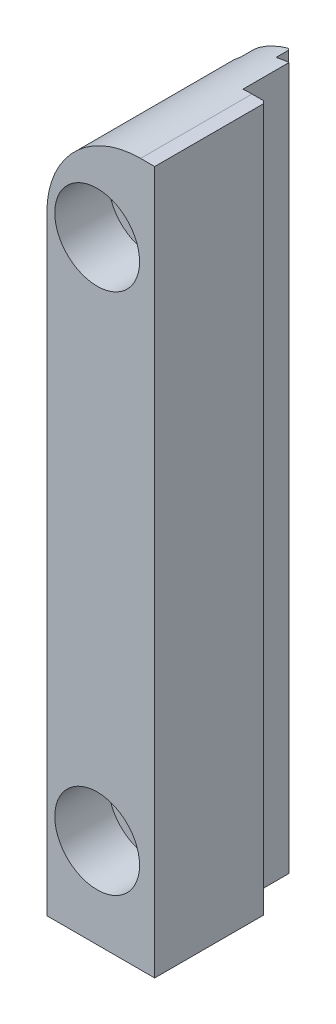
ISO-10303-21;
HEADER;
FILE_DESCRIPTION(('STEP AP214'),'2;1');
FILE_NAME('part.step','',(''),(''),'','','');
FILE_SCHEMA(('AUTOMOTIVE_DESIGN { 1 0 10303 214 1 1 1 1 }'));
ENDSEC;
DATA;
#1=APPLICATION_CONTEXT('core data for automotive mechanical design processes');
#2=APPLICATION_PROTOCOL_DEFINITION('international standard','automotive_design',2000,#1);
#3=PRODUCT_CONTEXT('',#1,'mechanical');
#4=PRODUCT('Part','Part','',(#3));
#5=PRODUCT_RELATED_PRODUCT_CATEGORY('part','',(#4));
#6=PRODUCT_DEFINITION_FORMATION('','',#4);
#7=PRODUCT_DEFINITION_CONTEXT('part definition',#1,'design');
#8=PRODUCT_DEFINITION('design','',#6,#7);
#9=PRODUCT_DEFINITION_SHAPE('','',#8);
#10=(LENGTH_UNIT() NAMED_UNIT(*) SI_UNIT(.MILLI.,.METRE.));
#11=(NAMED_UNIT(*) PLANE_ANGLE_UNIT() SI_UNIT($,.RADIAN.));
#12=(NAMED_UNIT(*) SI_UNIT($,.STERADIAN.) SOLID_ANGLE_UNIT());
#13=UNCERTAINTY_MEASURE_WITH_UNIT(LENGTH_MEASURE(1.E-05),#10,'distance_accuracy_value','');
#14=(GEOMETRIC_REPRESENTATION_CONTEXT(3) GLOBAL_UNCERTAINTY_ASSIGNED_CONTEXT((#13)) GLOBAL_UNIT_ASSIGNED_CONTEXT((#10,
#11,#12)) REPRESENTATION_CONTEXT('',''));
#15=CARTESIAN_POINT('',(0.,0.,0.));
#16=DIRECTION('',(0.,0.,1.));
#17=DIRECTION('',(1.,0.,0.));
#18=AXIS2_PLACEMENT_3D('',#15,#16,#17);
#19=CARTESIAN_POINT('',(-7.32028,29.845,-16.256));
#20=DIRECTION('',(0.,0.,-1.));
#21=DIRECTION('',(1.,0.,0.));
#22=AXIS2_PLACEMENT_3D('',#19,#20,#21);
#23=PLANE('',#22);
#24=CARTESIAN_POINT('',(-5.92328,26.924,-16.256));
#25=DIRECTION('',(0.,0.,-1.));
#26=DIRECTION('',(-1.,0.,0.));
#27=AXIS2_PLACEMENT_3D('',#24,#25,#26);
#28=CIRCLE('',#27,2.7051);
#29=CARTESIAN_POINT('',(-8.62838,26.924,-16.256));
#30=VERTEX_POINT('',#29);
#31=EDGE_CURVE('E343',#30,#30,#28,.T.);
#32=ORIENTED_EDGE('',*,*,#31,.F.);
#33=EDGE_LOOP('',(#32));
#34=FACE_BOUND('',#33,.T.);
#35=CARTESIAN_POINT('',(-5.92328,-26.924,-16.256));
#36=DIRECTION('',(0.,0.,-1.));
#37=DIRECTION('',(-1.,0.,0.));
#38=AXIS2_PLACEMENT_3D('',#35,#36,#37);
#39=CIRCLE('',#38,2.7051);
#40=CARTESIAN_POINT('',(-8.62838,-26.924,-16.256));
#41=VERTEX_POINT('',#40);
#42=EDGE_CURVE('E346',#41,#41,#39,.T.);
#43=ORIENTED_EDGE('',*,*,#42,.F.);
#44=EDGE_LOOP('',(#43));
#45=FACE_BOUND('',#44,.T.);
#46=CARTESIAN_POINT('',(-5.92328,26.924,-16.256));
#47=DIRECTION('',(0.,0.,1.));
#48=DIRECTION('',(1.,0.,0.));
#49=AXIS2_PLACEMENT_3D('',#46,#47,#48);
#50=CIRCLE('',#49,3.175);
#51=CARTESIAN_POINT('',(-2.74828,26.924,-16.256));
#52=VERTEX_POINT('',#51);
#53=CARTESIAN_POINT('',(-2.74828030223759,26.9226146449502,-16.256));
#54=VERTEX_POINT('',#53);
#55=EDGE_CURVE('E341',#52,#54,#50,.T.);
#56=ORIENTED_EDGE('',*,*,#55,.F.);
#57=DIRECTION('',(-1.,0.,0.));
#58=VECTOR('',#57,1.);
#59=CARTESIAN_POINT('',(-7.32028,26.924,-16.256));
#60=LINE('',#59,#58);
#61=CARTESIAN_POINT('',(-2.748026,26.924,-16.256));
#62=VERTEX_POINT('',#61);
#63=EDGE_CURVE('E24',#52,#62,#60,.F.);
#64=ORIENTED_EDGE('',*,*,#63,.T.);
#65=CARTESIAN_POINT('',(-5.92328,26.924,-16.256));
#66=DIRECTION('',(0.,0.,-1.));
#67=DIRECTION('',(-1.,0.,0.));
#68=AXIS2_PLACEMENT_3D('',#65,#66,#67);
#69=CIRCLE('',#68,3.175254);
#70=CARTESIAN_POINT('',(-3.76428,29.2522948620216,-16.256));
#71=VERTEX_POINT('',#70);
#72=EDGE_CURVE('E244',#71,#62,#69,.T.);
#73=ORIENTED_EDGE('',*,*,#72,.F.);
#74=DIRECTION('',(0.,-1.,0.));
#75=VECTOR('',#74,1.);
#76=CARTESIAN_POINT('',(-3.76428,29.845,-16.256));
#77=LINE('',#76,#75);
#78=CARTESIAN_POINT('',(-3.76428,35.9141543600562,-16.256));
#79=VERTEX_POINT('',#78);
#80=EDGE_CURVE('E401',#79,#71,#77,.T.);
#81=ORIENTED_EDGE('',*,*,#80,.F.);
#82=CARTESIAN_POINT('',(-1.45288,26.543,-16.256));
#83=DIRECTION('',(0.,0.,1.));
#84=DIRECTION('',(1.,0.,0.));
#85=AXIS2_PLACEMENT_3D('',#82,#83,#84);
#86=CIRCLE('',#85,9.652);
#87=CARTESIAN_POINT('',(-2.40538,36.1478866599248,-16.256));
#88=VERTEX_POINT('',#87);
#89=EDGE_CURVE('E457',#88,#79,#86,.T.);
#90=ORIENTED_EDGE('',*,*,#89,.F.);
#91=DIRECTION('',(0.,-1.,0.));
#92=VECTOR('',#91,1.);
#93=CARTESIAN_POINT('',(-2.40538,29.845,-16.256));
#94=LINE('',#93,#92);
#95=CARTESIAN_POINT('',(-2.40538,-36.195,-16.256));
#96=VERTEX_POINT('',#95);
#97=EDGE_CURVE('E611',#88,#96,#94,.T.);
#98=ORIENTED_EDGE('',*,*,#97,.T.);
#99=DIRECTION('',(-1.,0.,0.));
#100=VECTOR('',#99,1.);
#101=CARTESIAN_POINT('',(-11.07948,-36.195,-16.256));
#102=LINE('',#101,#100);
#103=CARTESIAN_POINT('',(-3.76428,-36.195,-16.256));
#104=VERTEX_POINT('',#103);
#105=EDGE_CURVE('E497',#96,#104,#102,.T.);
#106=ORIENTED_EDGE('',*,*,#105,.T.);
#107=CARTESIAN_POINT('',(-3.76428,-29.2522948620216,-16.256));
#108=VERTEX_POINT('',#107);
#109=EDGE_CURVE('E370',#108,#104,#77,.T.);
#110=ORIENTED_EDGE('',*,*,#109,.F.);
#111=CARTESIAN_POINT('',(-5.92328,-26.924,-16.256));
#112=DIRECTION('',(0.,0.,-1.));
#113=DIRECTION('',(-1.,0.,0.));
#114=AXIS2_PLACEMENT_3D('',#111,#112,#113);
#115=CIRCLE('',#114,3.175254);
#116=CARTESIAN_POINT('',(-2.74802630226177,-26.9253854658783,-16.256));
#117=VERTEX_POINT('',#116);
#118=EDGE_CURVE('E324',#117,#108,#115,.T.);
#119=ORIENTED_EDGE('',*,*,#118,.F.);
#120=DIRECTION('',(-0.999999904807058,0.000436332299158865,0.));
#121=VECTOR('',#120,1.);
#122=CARTESIAN_POINT('',(-7.34504987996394,-26.9233796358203,-16.256));
#123=LINE('',#122,#121);
#124=CARTESIAN_POINT('',(-2.7482803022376,-26.9253853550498,-16.256));
#125=VERTEX_POINT('',#124);
#126=EDGE_CURVE('E376',#117,#125,#123,.T.);
#127=ORIENTED_EDGE('',*,*,#126,.T.);
#128=CARTESIAN_POINT('',(-5.92328,-26.924,-16.256));
#129=DIRECTION('',(0.,0.,1.));
#130=DIRECTION('',(1.,0.,0.));
#131=AXIS2_PLACEMENT_3D('',#128,#129,#130);
#132=CIRCLE('',#131,3.175);
#133=CARTESIAN_POINT('',(-2.74828,-26.924,-16.256));
#134=VERTEX_POINT('',#133);
#135=EDGE_CURVE('E339',#134,#125,#132,.T.);
#136=ORIENTED_EDGE('',*,*,#135,.F.);
#137=DIRECTION('',(-1.,0.,0.));
#138=VECTOR('',#137,1.);
#139=CARTESIAN_POINT('',(-7.32028,-26.924,-16.256));
#140=LINE('',#139,#138);
#141=CARTESIAN_POINT('',(-2.748026,-26.924,-16.256));
#142=VERTEX_POINT('',#141);
#143=EDGE_CURVE('E373',#134,#142,#140,.F.);
#144=ORIENTED_EDGE('',*,*,#143,.T.);
#145=CARTESIAN_POINT('',(-3.76428,-24.5957051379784,-16.256));
#146=VERTEX_POINT('',#145);
#147=EDGE_CURVE('E323',#146,#142,#115,.T.);
#148=ORIENTED_EDGE('',*,*,#147,.F.);
#149=CARTESIAN_POINT('',(-3.76428,24.5957051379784,-16.256));
#150=VERTEX_POINT('',#149);
#151=EDGE_CURVE('E372',#150,#146,#77,.T.);
#152=ORIENTED_EDGE('',*,*,#151,.F.);
#153=CARTESIAN_POINT('',(-2.74802630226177,26.9226145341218,-16.256));
#154=VERTEX_POINT('',#153);
#155=EDGE_CURVE('E274',#154,#150,#69,.T.);
#156=ORIENTED_EDGE('',*,*,#155,.F.);
#157=DIRECTION('',(-0.999999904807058,0.000436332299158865,0.));
#158=VECTOR('',#157,1.);
#159=CARTESIAN_POINT('',(-7.32155426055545,26.9246101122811,-16.256));
#160=LINE('',#159,#158);
#161=EDGE_CURVE('E10',#154,#54,#160,.T.);
#162=ORIENTED_EDGE('',*,*,#161,.T.);
#163=EDGE_LOOP('',(#56,#64,#73,#81,#90,#98,#106,#110,#119,#127,#136,#144,#148,#152,#156,#162));
#164=FACE_BOUND('',#163,.T.);
#165=ADVANCED_FACE('F16',(#34,#45,#164),#23,.T.);
#166=CARTESIAN_POINT('',(-5.92328,26.924,-5.5372));
#167=DIRECTION('',(0.,0.,-1.));
#168=DIRECTION('',(-1.,0.,0.));
#169=AXIS2_PLACEMENT_3D('',#166,#167,#168);
#170=PLANE('',#169);
#171=CARTESIAN_POINT('',(-5.92328,26.924,-5.5372));
#172=DIRECTION('',(0.,0.,-1.));
#173=DIRECTION('',(-1.,0.,0.));
#174=AXIS2_PLACEMENT_3D('',#171,#172,#173);
#175=CIRCLE('',#174,2.7051);
#176=CARTESIAN_POINT('',(-8.62838,26.924,-5.5372));
#177=VERTEX_POINT('',#176);
#178=EDGE_CURVE('E483',#177,#177,#175,.F.);
#179=ORIENTED_EDGE('',*,*,#178,.F.);
#180=EDGE_LOOP('',(#179));
#181=FACE_BOUND('',#180,.T.);
#182=CARTESIAN_POINT('',(-5.92328,26.924,-5.5372));
#183=DIRECTION('',(0.,0.,-1.));
#184=DIRECTION('',(-1.,0.,0.));
#185=AXIS2_PLACEMENT_3D('',#182,#183,#184);
#186=CIRCLE('',#185,4.365625);
#187=CARTESIAN_POINT('',(-10.288905,26.924,-5.5372));
#188=VERTEX_POINT('',#187);
#189=EDGE_CURVE('E507',#188,#188,#186,.T.);
#190=ORIENTED_EDGE('',*,*,#189,.F.);
#191=EDGE_LOOP('',(#190));
#192=FACE_BOUND('',#191,.T.);
#193=CARTESIAN_POINT('',(-5.92328,26.924,-5.5372));
#194=DIRECTION('',(0.,0.,1.));
#195=DIRECTION('',(1.,0.,0.));
#196=AXIS2_PLACEMENT_3D('',#193,#194,#195);
#197=CIRCLE('',#196,3.175254);
#198=CARTESIAN_POINT('',(-2.748026,26.924,-5.5372));
#199=VERTEX_POINT('',#198);
#200=CARTESIAN_POINT('',(-2.74802630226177,26.9226145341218,-5.5372));
#201=VERTEX_POINT('',#200);
#202=EDGE_CURVE('E241',#199,#201,#197,.T.);
#203=ORIENTED_EDGE('',*,*,#202,.F.);
#204=DIRECTION('',(1.,0.,0.));
#205=VECTOR('',#204,1.);
#206=CARTESIAN_POINT('',(-2.74828,26.924,-5.5372));
#207=LINE('',#206,#205);
#208=CARTESIAN_POINT('',(-2.74828,26.924,-5.5372));
#209=VERTEX_POINT('',#208);
#210=EDGE_CURVE('E249',#199,#209,#207,.F.);
#211=ORIENTED_EDGE('',*,*,#210,.T.);
#212=CARTESIAN_POINT('',(-5.92328,26.924,-5.5372));
#213=DIRECTION('',(0.,0.,1.));
#214=DIRECTION('',(1.,0.,0.));
#215=AXIS2_PLACEMENT_3D('',#212,#213,#214);
#216=CIRCLE('',#215,3.175);
#217=CARTESIAN_POINT('',(-2.74828030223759,26.9226146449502,-5.5372));
#218=VERTEX_POINT('',#217);
#219=EDGE_CURVE('E264',#209,#218,#216,.T.);
#220=ORIENTED_EDGE('',*,*,#219,.T.);
#221=DIRECTION('',(0.999999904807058,-0.000436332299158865,0.));
#222=VECTOR('',#221,1.);
#223=CARTESIAN_POINT('',(-2.74828030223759,26.9226146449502,-5.5372));
#224=LINE('',#223,#222);
#225=EDGE_CURVE('E254',#201,#218,#224,.F.);
#226=ORIENTED_EDGE('',*,*,#225,.F.);
#227=EDGE_LOOP('',(#203,#211,#220,#226));
#228=FACE_BOUND('',#227,.T.);
#229=ADVANCED_FACE('F257',(#181,#192,#228),#170,.F.);
#230=CARTESIAN_POINT('',(-7.32028,24.0725742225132,-16.256));
#231=VERTEX_POINT('',#230);
#232=CARTESIAN_POINT('',(-7.32028,29.7754257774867,-16.256));
#233=VERTEX_POINT('',#232);
#234=EDGE_CURVE('E275',#231,#233,#69,.T.);
#235=ORIENTED_EDGE('',*,*,#234,.F.);
#236=DIRECTION('',(0.,-1.,0.));
#237=VECTOR('',#236,1.);
#238=CARTESIAN_POINT('',(-7.32028,29.845,-16.256));
#239=LINE('',#238,#237);
#240=CARTESIAN_POINT('',(-7.32028,-24.0725742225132,-16.256));
#241=VERTEX_POINT('',#240);
#242=EDGE_CURVE('E365',#231,#241,#239,.T.);
#243=ORIENTED_EDGE('',*,*,#242,.T.);
#244=CARTESIAN_POINT('',(-7.32028,-29.7754257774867,-16.256));
#245=VERTEX_POINT('',#244);
#246=EDGE_CURVE('E319',#245,#241,#115,.T.);
#247=ORIENTED_EDGE('',*,*,#246,.F.);
#248=CARTESIAN_POINT('',(-7.32028,-36.195,-16.256));
#249=VERTEX_POINT('',#248);
#250=EDGE_CURVE('E362',#245,#249,#239,.T.);
#251=ORIENTED_EDGE('',*,*,#250,.T.);
#252=DIRECTION('',(-1.,0.,0.));
#253=VECTOR('',#252,1.);
#254=CARTESIAN_POINT('',(-11.07948,-36.195,-16.256));
#255=LINE('',#254,#253);
#256=CARTESIAN_POINT('',(-11.10488,-36.195,-16.256));
#257=VERTEX_POINT('',#256);
#258=EDGE_CURVE('E475',#249,#257,#255,.T.);
#259=ORIENTED_EDGE('',*,*,#258,.T.);
#260=DIRECTION('',(0.,-1.,0.));
#261=VECTOR('',#260,1.);
#262=CARTESIAN_POINT('',(-11.10488,29.845,-16.256));
#263=LINE('',#262,#261);
#264=CARTESIAN_POINT('',(-11.10488,26.543,-16.256));
#265=VERTEX_POINT('',#264);
#266=EDGE_CURVE('E366',#265,#257,#263,.T.);
#267=ORIENTED_EDGE('',*,*,#266,.F.);
#268=CARTESIAN_POINT('',(-1.45288,26.543,-16.256));
#269=DIRECTION('',(0.,0.,1.));
#270=DIRECTION('',(1.,0.,0.));
#271=AXIS2_PLACEMENT_3D('',#268,#269,#270);
#272=CIRCLE('',#271,9.652);
#273=CARTESIAN_POINT('',(-7.32028,34.2068581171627,-16.256));
#274=VERTEX_POINT('',#273);
#275=EDGE_CURVE('E433',#274,#265,#272,.T.);
#276=ORIENTED_EDGE('',*,*,#275,.F.);
#277=EDGE_CURVE('E357',#274,#233,#239,.T.);
#278=ORIENTED_EDGE('',*,*,#277,.T.);
#279=EDGE_LOOP('',(#235,#243,#247,#251,#259,#267,#276,#278));
#280=FACE_BOUND('',#279,.T.);
#281=ADVANCED_FACE('F431',(#280),#23,.T.);
#282=CARTESIAN_POINT('',(-5.92328,-26.924,-5.5372));
#283=DIRECTION('',(0.,0.,-1.));
#284=DIRECTION('',(-1.,0.,0.));
#285=AXIS2_PLACEMENT_3D('',#282,#283,#284);
#286=PLANE('',#285);
#287=CARTESIAN_POINT('',(-5.92328,-26.924,-5.5372));
#288=DIRECTION('',(0.,0.,-1.));
#289=DIRECTION('',(-1.,0.,0.));
#290=AXIS2_PLACEMENT_3D('',#287,#288,#289);
#291=CIRCLE('',#290,2.7051);
#292=CARTESIAN_POINT('',(-8.62838,-26.924,-5.5372));
#293=VERTEX_POINT('',#292);
#294=EDGE_CURVE('E515',#293,#293,#291,.F.);
#295=ORIENTED_EDGE('',*,*,#294,.F.);
#296=EDGE_LOOP('',(#295));
#297=FACE_BOUND('',#296,.T.);
#298=CARTESIAN_POINT('',(-5.92328,-26.924,-5.5372));
#299=DIRECTION('',(0.,0.,-1.));
#300=DIRECTION('',(-1.,0.,0.));
#301=AXIS2_PLACEMENT_3D('',#298,#299,#300);
#302=CIRCLE('',#301,4.365625);
#303=CARTESIAN_POINT('',(-10.288905,-26.924,-5.5372));
#304=VERTEX_POINT('',#303);
#305=EDGE_CURVE('E518',#304,#304,#302,.T.);
#306=ORIENTED_EDGE('',*,*,#305,.F.);
#307=EDGE_LOOP('',(#306));
#308=FACE_BOUND('',#307,.T.);
#309=CARTESIAN_POINT('',(-5.92328,-26.924,-5.5372));
#310=DIRECTION('',(0.,0.,1.));
#311=DIRECTION('',(1.,0.,0.));
#312=AXIS2_PLACEMENT_3D('',#309,#310,#311);
#313=CIRCLE('',#312,3.175254);
#314=CARTESIAN_POINT('',(-2.748026,-26.924,-5.5372));
#315=VERTEX_POINT('',#314);
#316=CARTESIAN_POINT('',(-2.74802630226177,-26.9253854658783,-5.5372));
#317=VERTEX_POINT('',#316);
#318=EDGE_CURVE('E292',#315,#317,#313,.T.);
#319=ORIENTED_EDGE('',*,*,#318,.F.);
#320=DIRECTION('',(1.,0.,0.));
#321=VECTOR('',#320,1.);
#322=CARTESIAN_POINT('',(-2.74828,-26.924,-5.5372));
#323=LINE('',#322,#321);
#324=CARTESIAN_POINT('',(-2.74828,-26.924,-5.5372));
#325=VERTEX_POINT('',#324);
#326=EDGE_CURVE('E307',#315,#325,#323,.F.);
#327=ORIENTED_EDGE('',*,*,#326,.T.);
#328=CARTESIAN_POINT('',(-5.92328,-26.924,-5.5372));
#329=DIRECTION('',(0.,0.,1.));
#330=DIRECTION('',(1.,0.,0.));
#331=AXIS2_PLACEMENT_3D('',#328,#329,#330);
#332=CIRCLE('',#331,3.175);
#333=CARTESIAN_POINT('',(-2.7482803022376,-26.9253853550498,-5.5372));
#334=VERTEX_POINT('',#333);
#335=EDGE_CURVE('E300',#325,#334,#332,.T.);
#336=ORIENTED_EDGE('',*,*,#335,.T.);
#337=DIRECTION('',(0.999999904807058,-0.000436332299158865,0.));
#338=VECTOR('',#337,1.);
#339=CARTESIAN_POINT('',(-2.7482803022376,-26.9253853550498,-5.5372));
#340=LINE('',#339,#338);
#341=EDGE_CURVE('E304',#317,#334,#340,.F.);
#342=ORIENTED_EDGE('',*,*,#341,.F.);
#343=EDGE_LOOP('',(#319,#327,#336,#342));
#344=FACE_BOUND('',#343,.T.);
#345=ADVANCED_FACE('F18',(#297,#308,#344),#286,.F.);
#346=CARTESIAN_POINT('',(-3.76428,29.845,-16.256));
#347=DIRECTION('',(1.,0.,0.));
#348=DIRECTION('',(0.,0.,1.));
#349=AXIS2_PLACEMENT_3D('',#346,#347,#348);
#350=PLANE('',#349);
#351=DIRECTION('',(0.,0.,1.));
#352=VECTOR('',#351,1.);
#353=CARTESIAN_POINT('',(-3.76428,29.2522948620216,-5.5372));
#354=LINE('',#353,#352);
#355=CARTESIAN_POINT('',(-3.76428,29.2522948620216,-17.526));
#356=VERTEX_POINT('',#355);
#357=EDGE_CURVE('E270',#356,#71,#354,.T.);
#358=ORIENTED_EDGE('',*,*,#357,.F.);
#359=DIRECTION('',(0.,1.,0.));
#360=VECTOR('',#359,1.);
#361=CARTESIAN_POINT('',(-3.76428,29.845,-17.526));
#362=LINE('',#361,#360);
#363=CARTESIAN_POINT('',(-3.76428,35.9141543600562,-17.526));
#364=VERTEX_POINT('',#363);
#365=EDGE_CURVE('E448',#356,#364,#362,.T.);
#366=ORIENTED_EDGE('',*,*,#365,.T.);
#367=DIRECTION('',(0.,0.,1.));
#368=VECTOR('',#367,1.);
#369=CARTESIAN_POINT('',(-3.76428,35.9141543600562,-16.256));
#370=LINE('',#369,#368);
#371=EDGE_CURVE('E452',#79,#364,#370,.F.);
#372=ORIENTED_EDGE('',*,*,#371,.F.);
#373=ORIENTED_EDGE('',*,*,#80,.T.);
#374=EDGE_LOOP('',(#358,#366,#372,#373));
#375=FACE_BOUND('',#374,.T.);
#376=ADVANCED_FACE('F537',(#375),#350,.T.);
#377=CARTESIAN_POINT('',(-3.76428,29.845,-17.78));
#378=DIRECTION('',(0.,0.,-1.));
#379=DIRECTION('',(1.,0.,0.));
#380=AXIS2_PLACEMENT_3D('',#377,#378,#379);
#381=PLANE('',#380);
#382=CARTESIAN_POINT('',(-5.92328,26.924,-17.78));
#383=DIRECTION('',(0.,0.,-1.));
#384=DIRECTION('',(-1.,0.,0.));
#385=AXIS2_PLACEMENT_3D('',#382,#383,#384);
#386=CIRCLE('',#385,3.175254);
#387=CARTESIAN_POINT('',(-7.06628,29.886395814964,-17.78));
#388=VERTEX_POINT('',#387);
#389=CARTESIAN_POINT('',(-4.01828,29.4643174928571,-17.78));
#390=VERTEX_POINT('',#389);
#391=EDGE_CURVE('E31',#388,#390,#386,.T.);
#392=ORIENTED_EDGE('',*,*,#391,.F.);
#393=DIRECTION('',(0.,1.,0.));
#394=VECTOR('',#393,1.);
#395=CARTESIAN_POINT('',(-7.06628,29.845,-17.78));
#396=LINE('',#395,#394);
#397=CARTESIAN_POINT('',(-7.06628,34.3948051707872,-17.78));
#398=VERTEX_POINT('',#397);
#399=EDGE_CURVE('E403',#388,#398,#396,.T.);
#400=ORIENTED_EDGE('',*,*,#399,.T.);
#401=CARTESIAN_POINT('',(-1.45288,26.543,-17.78));
#402=DIRECTION('',(0.,0.,1.));
#403=DIRECTION('',(1.,0.,0.));
#404=AXIS2_PLACEMENT_3D('',#401,#402,#403);
#405=CIRCLE('',#404,9.652);
#406=CARTESIAN_POINT('',(-4.01828,35.8478281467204,-17.78));
#407=VERTEX_POINT('',#406);
#408=EDGE_CURVE('E440',#407,#398,#405,.T.);
#409=ORIENTED_EDGE('',*,*,#408,.F.);
#410=DIRECTION('',(0.,-1.,0.));
#411=VECTOR('',#410,1.);
#412=CARTESIAN_POINT('',(-4.01828,29.845,-17.78));
#413=LINE('',#412,#411);
#414=EDGE_CURVE('E395',#407,#390,#413,.T.);
#415=ORIENTED_EDGE('',*,*,#414,.T.);
#416=EDGE_LOOP('',(#392,#400,#409,#415));
#417=FACE_BOUND('',#416,.T.);
#418=ADVANCED_FACE('F546',(#417),#381,.T.);
#419=CARTESIAN_POINT('',(-7.32028,29.845,-17.526));
#420=DIRECTION('',(0.707106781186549,0.,0.707106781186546));
#421=DIRECTION('',(0.707106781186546,0.,-0.707106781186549));
#422=AXIS2_PLACEMENT_3D('',#419,#420,#421);
#423=PLANE('',#422);
#424=CARTESIAN_POINT('',(-5.92328,26.924,-18.923));
#425=DIRECTION('',(0.707106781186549,0.,0.707106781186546));
#426=DIRECTION('',(-0.707106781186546,0.,0.707106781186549));
#427=AXIS2_PLACEMENT_3D('',#424,#425,#426);
#428=ELLIPSE('',#427,4.49048727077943,3.175254);
#429=CARTESIAN_POINT('',(-7.32028,29.7754257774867,-17.526));
#430=VERTEX_POINT('',#429);
#431=EDGE_CURVE('E273',#430,#388,#428,.F.);
#432=ORIENTED_EDGE('',*,*,#431,.F.);
#433=DIRECTION('',(0.,-1.,0.));
#434=VECTOR('',#433,1.);
#435=CARTESIAN_POINT('',(-7.32028,29.845,-17.526));
#436=LINE('',#435,#434);
#437=CARTESIAN_POINT('',(-7.32028,34.2068581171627,-17.526));
#438=VERTEX_POINT('',#437);
#439=EDGE_CURVE('E429',#438,#430,#436,.T.);
#440=ORIENTED_EDGE('',*,*,#439,.F.);
#441=CARTESIAN_POINT('',(-1.45288,26.543,-23.3934));
#442=DIRECTION('',(0.707106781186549,0.,0.707106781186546));
#443=DIRECTION('',(-0.707106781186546,0.,0.707106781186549));
#444=AXIS2_PLACEMENT_3D('',#441,#442,#443);
#445=ELLIPSE('',#444,13.6499893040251,9.652);
#446=EDGE_CURVE('E446',#398,#438,#445,.T.);
#447=ORIENTED_EDGE('',*,*,#446,.F.);
#448=ORIENTED_EDGE('',*,*,#399,.F.);
#449=EDGE_LOOP('',(#432,#440,#447,#448));
#450=FACE_BOUND('',#449,.T.);
#451=ADVANCED_FACE('F550',(#450),#423,.F.);
#452=CARTESIAN_POINT('',(-7.32028,29.845,-17.78));
#453=DIRECTION('',(-1.,0.,0.));
#454=DIRECTION('',(0.,0.,-1.));
#455=AXIS2_PLACEMENT_3D('',#452,#453,#454);
#456=PLANE('',#455);
#457=DIRECTION('',(0.,0.,1.));
#458=VECTOR('',#457,1.);
#459=CARTESIAN_POINT('',(-7.32028,24.0725742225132,-5.5372));
#460=LINE('',#459,#458);
#461=CARTESIAN_POINT('',(-7.32028,24.0725742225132,-17.526));
#462=VERTEX_POINT('',#461);
#463=EDGE_CURVE('E279',#462,#231,#460,.T.);
#464=ORIENTED_EDGE('',*,*,#463,.F.);
#465=CARTESIAN_POINT('',(-7.32028,-24.0725742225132,-17.526));
#466=VERTEX_POINT('',#465);
#467=EDGE_CURVE('E399',#462,#466,#436,.T.);
#468=ORIENTED_EDGE('',*,*,#467,.T.);
#469=DIRECTION('',(0.,0.,1.));
#470=VECTOR('',#469,1.);
#471=CARTESIAN_POINT('',(-7.32028,-24.0725742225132,-5.5372));
#472=LINE('',#471,#470);
#473=EDGE_CURVE('E326',#241,#466,#472,.F.);
#474=ORIENTED_EDGE('',*,*,#473,.F.);
#475=ORIENTED_EDGE('',*,*,#242,.F.);
#476=EDGE_LOOP('',(#464,#468,#474,#475));
#477=FACE_BOUND('',#476,.T.);
#478=ADVANCED_FACE('F554',(#477),#456,.T.);
#479=CARTESIAN_POINT('',(-4.01828,29.845,-17.78));
#480=DIRECTION('',(-0.707106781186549,0.,0.707106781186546));
#481=DIRECTION('',(0.707106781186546,0.,0.707106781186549));
#482=AXIS2_PLACEMENT_3D('',#479,#480,#481);
#483=PLANE('',#482);
#484=CARTESIAN_POINT('',(-5.92328,26.924,-19.685));
#485=DIRECTION('',(-0.707106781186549,0.,0.707106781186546));
#486=DIRECTION('',(0.707106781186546,0.,0.707106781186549));
#487=AXIS2_PLACEMENT_3D('',#484,#485,#486);
#488=ELLIPSE('',#487,4.49048727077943,3.175254);
#489=CARTESIAN_POINT('',(-3.76428,24.5957051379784,-17.526));
#490=VERTEX_POINT('',#489);
#491=CARTESIAN_POINT('',(-4.01828,24.3836825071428,-17.78));
#492=VERTEX_POINT('',#491);
#493=EDGE_CURVE('E285',#490,#492,#488,.F.);
#494=ORIENTED_EDGE('',*,*,#493,.F.);
#495=CARTESIAN_POINT('',(-3.76428,-24.5957051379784,-17.526));
#496=VERTEX_POINT('',#495);
#497=EDGE_CURVE('E527',#496,#490,#362,.T.);
#498=ORIENTED_EDGE('',*,*,#497,.F.);
#499=CARTESIAN_POINT('',(-5.92328,-26.924,-19.685));
#500=DIRECTION('',(-0.707106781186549,0.,0.707106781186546));
#501=DIRECTION('',(0.707106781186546,0.,0.707106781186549));
#502=AXIS2_PLACEMENT_3D('',#499,#500,#501);
#503=ELLIPSE('',#502,4.49048727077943,3.175254);
#504=CARTESIAN_POINT('',(-4.01828,-24.3836825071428,-17.78));
#505=VERTEX_POINT('',#504);
#506=EDGE_CURVE('E334',#505,#496,#503,.F.);
#507=ORIENTED_EDGE('',*,*,#506,.F.);
#508=EDGE_CURVE('E383',#492,#505,#413,.T.);
#509=ORIENTED_EDGE('',*,*,#508,.F.);
#510=EDGE_LOOP('',(#494,#498,#507,#509));
#511=FACE_BOUND('',#510,.T.);
#512=ADVANCED_FACE('F635',(#511),#483,.F.);
#513=DIRECTION('',(0.,0.,1.));
#514=VECTOR('',#513,1.);
#515=CARTESIAN_POINT('',(-3.76428,24.5957051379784,-5.5372));
#516=LINE('',#515,#514);
#517=EDGE_CURVE('E287',#150,#490,#516,.F.);
#518=ORIENTED_EDGE('',*,*,#517,.F.);
#519=ORIENTED_EDGE('',*,*,#151,.T.);
#520=DIRECTION('',(0.,0.,1.));
#521=VECTOR('',#520,1.);
#522=CARTESIAN_POINT('',(-3.76428,-24.5957051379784,-5.5372));
#523=LINE('',#522,#521);
#524=EDGE_CURVE('E336',#496,#146,#523,.T.);
#525=ORIENTED_EDGE('',*,*,#524,.F.);
#526=ORIENTED_EDGE('',*,*,#497,.T.);
#527=EDGE_LOOP('',(#518,#519,#525,#526));
#528=FACE_BOUND('',#527,.T.);
#529=ADVANCED_FACE('F649',(#528),#350,.T.);
#530=CARTESIAN_POINT('',(-5.92328,26.924,-17.78));
#531=DIRECTION('',(0.,0.,-1.));
#532=DIRECTION('',(-1.,0.,0.));
#533=AXIS2_PLACEMENT_3D('',#530,#531,#532);
#534=CIRCLE('',#533,3.175254);
#535=CARTESIAN_POINT('',(-7.06628,23.961604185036,-17.78));
#536=VERTEX_POINT('',#535);
#537=EDGE_CURVE('E283',#492,#536,#534,.T.);
#538=ORIENTED_EDGE('',*,*,#537,.F.);
#539=ORIENTED_EDGE('',*,*,#508,.T.);
#540=CARTESIAN_POINT('',(-5.92328,-26.924,-17.78));
#541=DIRECTION('',(0.,0.,-1.));
#542=DIRECTION('',(-1.,0.,0.));
#543=AXIS2_PLACEMENT_3D('',#540,#541,#542);
#544=CIRCLE('',#543,3.175254);
#545=CARTESIAN_POINT('',(-7.06628,-23.961604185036,-17.78));
#546=VERTEX_POINT('',#545);
#547=EDGE_CURVE('E331',#546,#505,#544,.T.);
#548=ORIENTED_EDGE('',*,*,#547,.F.);
#549=EDGE_CURVE('E385',#546,#536,#396,.T.);
#550=ORIENTED_EDGE('',*,*,#549,.T.);
#551=EDGE_LOOP('',(#538,#539,#548,#550));
#552=FACE_BOUND('',#551,.T.);
#553=ADVANCED_FACE('F807',(#552),#381,.T.);
#554=DIRECTION('',(0.,0.,1.));
#555=VECTOR('',#554,1.);
#556=CARTESIAN_POINT('',(-7.32028,-29.7754257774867,-5.5372));
#557=LINE('',#556,#555);
#558=CARTESIAN_POINT('',(-7.32028,-29.7754257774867,-17.526));
#559=VERTEX_POINT('',#558);
#560=EDGE_CURVE('E317',#559,#245,#557,.T.);
#561=ORIENTED_EDGE('',*,*,#560,.F.);
#562=CARTESIAN_POINT('',(-7.32028,-36.195,-17.526));
#563=VERTEX_POINT('',#562);
#564=EDGE_CURVE('E367',#559,#563,#436,.T.);
#565=ORIENTED_EDGE('',*,*,#564,.T.);
#566=DIRECTION('',(0.,0.,1.));
#567=VECTOR('',#566,1.);
#568=CARTESIAN_POINT('',(-7.32028,-36.195,-11.4808));
#569=LINE('',#568,#567);
#570=EDGE_CURVE('E472',#563,#249,#569,.T.);
#571=ORIENTED_EDGE('',*,*,#570,.T.);
#572=ORIENTED_EDGE('',*,*,#250,.F.);
#573=EDGE_LOOP('',(#561,#565,#571,#572));
#574=FACE_BOUND('',#573,.T.);
#575=ADVANCED_FACE('F583',(#574),#456,.T.);
#576=CARTESIAN_POINT('',(-5.92328,26.924,-18.923));
#577=DIRECTION('',(0.707106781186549,0.,0.707106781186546));
#578=DIRECTION('',(-0.707106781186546,0.,0.707106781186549));
#579=AXIS2_PLACEMENT_3D('',#576,#577,#578);
#580=ELLIPSE('',#579,4.49048727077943,3.175254);
#581=EDGE_CURVE('E281',#536,#462,#580,.F.);
#582=ORIENTED_EDGE('',*,*,#581,.F.);
#583=ORIENTED_EDGE('',*,*,#549,.F.);
#584=CARTESIAN_POINT('',(-5.92328,-26.924,-18.923));
#585=DIRECTION('',(0.707106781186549,0.,0.707106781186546));
#586=DIRECTION('',(-0.707106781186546,0.,0.707106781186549));
#587=AXIS2_PLACEMENT_3D('',#584,#585,#586);
#588=ELLIPSE('',#587,4.49048727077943,3.175254);
#589=EDGE_CURVE('E329',#466,#546,#588,.F.);
#590=ORIENTED_EDGE('',*,*,#589,.F.);
#591=ORIENTED_EDGE('',*,*,#467,.F.);
#592=EDGE_LOOP('',(#582,#583,#590,#591));
#593=FACE_BOUND('',#592,.T.);
#594=ADVANCED_FACE('F563',(#593),#423,.F.);
#595=CARTESIAN_POINT('',(-5.92328,-26.924,-19.685));
#596=DIRECTION('',(-0.707106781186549,0.,0.707106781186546));
#597=DIRECTION('',(0.707106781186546,0.,0.707106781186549));
#598=AXIS2_PLACEMENT_3D('',#595,#596,#597);
#599=ELLIPSE('',#598,4.49048727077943,3.175254);
#600=CARTESIAN_POINT('',(-3.76428,-29.2522948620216,-17.526));
#601=VERTEX_POINT('',#600);
#602=CARTESIAN_POINT('',(-4.01828,-29.4643174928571,-17.78));
#603=VERTEX_POINT('',#602);
#604=EDGE_CURVE('E315',#601,#603,#599,.F.);
#605=ORIENTED_EDGE('',*,*,#604,.F.);
#606=CARTESIAN_POINT('',(-3.76428,-36.195,-17.526));
#607=VERTEX_POINT('',#606);
#608=EDGE_CURVE('E523',#607,#601,#362,.T.);
#609=ORIENTED_EDGE('',*,*,#608,.F.);
#610=DIRECTION('',(-0.707106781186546,0.,-0.707106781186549));
#611=VECTOR('',#610,1.);
#612=CARTESIAN_POINT('',(-4.01828,-36.195,-17.78));
#613=LINE('',#612,#611);
#614=CARTESIAN_POINT('',(-4.01828,-36.195,-17.78));
#615=VERTEX_POINT('',#614);
#616=EDGE_CURVE('E492',#615,#607,#613,.F.);
#617=ORIENTED_EDGE('',*,*,#616,.F.);
#618=EDGE_CURVE('E380',#603,#615,#413,.T.);
#619=ORIENTED_EDGE('',*,*,#618,.F.);
#620=EDGE_LOOP('',(#605,#609,#617,#619));
#621=FACE_BOUND('',#620,.T.);
#622=ADVANCED_FACE('F630',(#621),#483,.F.);
#623=CARTESIAN_POINT('',(-5.92328,-26.924,0.));
#624=DIRECTION('',(0.,0.,-1.));
#625=DIRECTION('',(-1.,0.,0.));
#626=AXIS2_PLACEMENT_3D('',#623,#624,#625);
#627=CYLINDRICAL_SURFACE('',#626,2.7051);
#628=ORIENTED_EDGE('',*,*,#294,.T.);
#629=EDGE_LOOP('',(#628));
#630=FACE_BOUND('',#629,.T.);
#631=ORIENTED_EDGE('',*,*,#42,.T.);
#632=EDGE_LOOP('',(#631));
#633=FACE_BOUND('',#632,.T.);
#634=ADVANCED_FACE('F633',(#630,#633),#627,.F.);
#635=CARTESIAN_POINT('',(-5.92328,26.924,0.));
#636=DIRECTION('',(0.,0.,-1.));
#637=DIRECTION('',(-1.,0.,0.));
#638=AXIS2_PLACEMENT_3D('',#635,#636,#637);
#639=CYLINDRICAL_SURFACE('',#638,2.7051);
#640=ORIENTED_EDGE('',*,*,#178,.T.);
#641=EDGE_LOOP('',(#640));
#642=FACE_BOUND('',#641,.T.);
#643=ORIENTED_EDGE('',*,*,#31,.T.);
#644=EDGE_LOOP('',(#643));
#645=FACE_BOUND('',#644,.T.);
#646=ADVANCED_FACE('F641',(#642,#645),#639,.F.);
#647=CARTESIAN_POINT('',(-11.10488,29.845,-16.256));
#648=DIRECTION('',(-1.,0.,0.));
#649=DIRECTION('',(0.,0.,-1.));
#650=AXIS2_PLACEMENT_3D('',#647,#648,#649);
#651=PLANE('',#650);
#652=ORIENTED_EDGE('',*,*,#266,.T.);
#653=DIRECTION('',(0.,0.,1.));
#654=VECTOR('',#653,1.);
#655=CARTESIAN_POINT('',(-11.10488,-36.195,-11.4808));
#656=LINE('',#655,#654);
#657=CARTESIAN_POINT('',(-11.10488,-36.195,0.));
#658=VERTEX_POINT('',#657);
#659=EDGE_CURVE('E479',#257,#658,#656,.T.);
#660=ORIENTED_EDGE('',*,*,#659,.T.);
#661=DIRECTION('',(0.,-1.,0.));
#662=VECTOR('',#661,1.);
#663=CARTESIAN_POINT('',(-11.10488,29.845,0.));
#664=LINE('',#663,#662);
#665=CARTESIAN_POINT('',(-11.10488,26.543,0.));
#666=VERTEX_POINT('',#665);
#667=EDGE_CURVE('E592',#666,#658,#664,.T.);
#668=ORIENTED_EDGE('',*,*,#667,.F.);
#669=DIRECTION('',(0.,0.,1.));
#670=VECTOR('',#669,1.);
#671=CARTESIAN_POINT('',(-11.10488,26.543,-16.256));
#672=LINE('',#671,#670);
#673=EDGE_CURVE('E443',#265,#666,#672,.T.);
#674=ORIENTED_EDGE('',*,*,#673,.F.);
#675=EDGE_LOOP('',(#652,#660,#668,#674));
#676=FACE_BOUND('',#675,.T.);
#677=ADVANCED_FACE('F591',(#676),#651,.T.);
#678=CARTESIAN_POINT('',(-11.07948,29.845,0.));
#679=DIRECTION('',(0.,0.,1.));
#680=DIRECTION('',(-1.,0.,0.));
#681=AXIS2_PLACEMENT_3D('',#678,#679,#680);
#682=PLANE('',#681);
#683=CARTESIAN_POINT('',(-5.92328,-26.924,0.));
#684=DIRECTION('',(0.,0.,1.));
#685=DIRECTION('',(1.,0.,0.));
#686=AXIS2_PLACEMENT_3D('',#683,#684,#685);
#687=CIRCLE('',#686,4.365625);
#688=CARTESIAN_POINT('',(-1.557655,-26.924,0.));
#689=VERTEX_POINT('',#688);
#690=EDGE_CURVE('E349',#689,#689,#687,.F.);
#691=ORIENTED_EDGE('',*,*,#690,.T.);
#692=EDGE_LOOP('',(#691));
#693=FACE_BOUND('',#692,.T.);
#694=CARTESIAN_POINT('',(-5.92328,26.924,0.));
#695=DIRECTION('',(0.,0.,1.));
#696=DIRECTION('',(1.,0.,0.));
#697=AXIS2_PLACEMENT_3D('',#694,#695,#696);
#698=CIRCLE('',#697,4.365625);
#699=CARTESIAN_POINT('',(-1.557655,26.924,0.));
#700=VERTEX_POINT('',#699);
#701=EDGE_CURVE('E510',#700,#700,#698,.F.);
#702=ORIENTED_EDGE('',*,*,#701,.T.);
#703=EDGE_LOOP('',(#702));
#704=FACE_BOUND('',#703,.T.);
#705=ORIENTED_EDGE('',*,*,#667,.T.);
#706=DIRECTION('',(1.,0.,0.));
#707=VECTOR('',#706,1.);
#708=CARTESIAN_POINT('',(-11.07948,-36.195,0.));
#709=LINE('',#708,#707);
#710=CARTESIAN_POINT('',(0.,-36.195,0.));
#711=VERTEX_POINT('',#710);
#712=EDGE_CURVE('E482',#658,#711,#709,.T.);
#713=ORIENTED_EDGE('',*,*,#712,.T.);
#714=DIRECTION('',(0.,-1.,0.));
#715=VECTOR('',#714,1.);
#716=CARTESIAN_POINT('',(0.,29.845,0.));
#717=LINE('',#716,#715);
#718=CARTESIAN_POINT('',(0.,36.195,0.));
#719=VERTEX_POINT('',#718);
#720=EDGE_CURVE('E604',#719,#711,#717,.T.);
#721=ORIENTED_EDGE('',*,*,#720,.F.);
#722=DIRECTION('',(1.,0.,0.));
#723=VECTOR('',#722,1.);
#724=CARTESIAN_POINT('',(-11.07948,36.195,0.));
#725=LINE('',#724,#723);
#726=CARTESIAN_POINT('',(-1.45288,36.195,0.));
#727=VERTEX_POINT('',#726);
#728=EDGE_CURVE('E478',#727,#719,#725,.T.);
#729=ORIENTED_EDGE('',*,*,#728,.F.);
#730=CARTESIAN_POINT('',(-1.45288,26.543,0.));
#731=DIRECTION('',(0.,0.,-1.));
#732=DIRECTION('',(-1.,0.,0.));
#733=AXIS2_PLACEMENT_3D('',#730,#731,#732);
#734=CIRCLE('',#733,9.652);
#735=EDGE_CURVE('E598',#666,#727,#734,.T.);
#736=ORIENTED_EDGE('',*,*,#735,.F.);
#737=EDGE_LOOP('',(#705,#713,#721,#729,#736));
#738=FACE_BOUND('',#737,.T.);
#739=ADVANCED_FACE('F719',(#693,#704,#738),#682,.T.);
#740=CARTESIAN_POINT('',(0.,29.845,0.));
#741=DIRECTION('',(1.,0.,0.));
#742=DIRECTION('',(0.,0.,1.));
#743=AXIS2_PLACEMENT_3D('',#740,#741,#742);
#744=PLANE('',#743);
#745=DIRECTION('',(0.,0.,-1.));
#746=VECTOR('',#745,1.);
#747=CARTESIAN_POINT('',(0.,-36.195,-11.4808));
#748=LINE('',#747,#746);
#749=CARTESIAN_POINT('',(0.,-36.195,-11.2268));
#750=VERTEX_POINT('',#749);
#751=EDGE_CURVE('E486',#711,#750,#748,.T.);
#752=ORIENTED_EDGE('',*,*,#751,.T.);
#753=DIRECTION('',(0.,1.,0.));
#754=VECTOR('',#753,1.);
#755=CARTESIAN_POINT('',(0.,29.845,-11.2268));
#756=LINE('',#755,#754);
#757=CARTESIAN_POINT('',(0.,36.195,-11.2268));
#758=VERTEX_POINT('',#757);
#759=EDGE_CURVE('E471',#750,#758,#756,.T.);
#760=ORIENTED_EDGE('',*,*,#759,.T.);
#761=DIRECTION('',(0.,0.,-1.));
#762=VECTOR('',#761,1.);
#763=CARTESIAN_POINT('',(0.,36.195,-11.4808));
#764=LINE('',#763,#762);
#765=EDGE_CURVE('E469',#719,#758,#764,.T.);
#766=ORIENTED_EDGE('',*,*,#765,.F.);
#767=ORIENTED_EDGE('',*,*,#720,.T.);
#768=EDGE_LOOP('',(#752,#760,#766,#767));
#769=FACE_BOUND('',#768,.T.);
#770=ADVANCED_FACE('F718',(#769),#744,.T.);
#771=CARTESIAN_POINT('',(0.00380999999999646,29.845,-11.4808));
#772=DIRECTION('',(0.,0.,-1.));
#773=DIRECTION('',(1.,0.,0.));
#774=AXIS2_PLACEMENT_3D('',#771,#772,#773);
#775=PLANE('',#774);
#776=DIRECTION('',(-1.,0.,0.));
#777=VECTOR('',#776,1.);
#778=CARTESIAN_POINT('',(0.00380999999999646,36.195,-11.4808));
#779=LINE('',#778,#777);
#780=CARTESIAN_POINT('',(-0.254000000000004,36.195,-11.4808));
#781=VERTEX_POINT('',#780);
#782=CARTESIAN_POINT('',(-1.45288,36.195,-11.4808));
#783=VERTEX_POINT('',#782);
#784=EDGE_CURVE('E467',#781,#783,#779,.T.);
#785=ORIENTED_EDGE('',*,*,#784,.F.);
#786=DIRECTION('',(0.,-1.,0.));
#787=VECTOR('',#786,1.);
#788=CARTESIAN_POINT('',(-0.254000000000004,29.845,-11.4808));
#789=LINE('',#788,#787);
#790=CARTESIAN_POINT('',(-0.254000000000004,-36.195,-11.4808));
#791=VERTEX_POINT('',#790);
#792=EDGE_CURVE('E526',#781,#791,#789,.T.);
#793=ORIENTED_EDGE('',*,*,#792,.T.);
#794=DIRECTION('',(-1.,0.,0.));
#795=VECTOR('',#794,1.);
#796=CARTESIAN_POINT('',(-11.07948,-36.195,-11.4808));
#797=LINE('',#796,#795);
#798=CARTESIAN_POINT('',(-2.40538,-36.195,-11.4808));
#799=VERTEX_POINT('',#798);
#800=EDGE_CURVE('E489',#791,#799,#797,.T.);
#801=ORIENTED_EDGE('',*,*,#800,.T.);
#802=DIRECTION('',(0.,-1.,0.));
#803=VECTOR('',#802,1.);
#804=CARTESIAN_POINT('',(-2.40538,29.845,-11.4808));
#805=LINE('',#804,#803);
#806=CARTESIAN_POINT('',(-2.40538,36.1478866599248,-11.4808));
#807=VERTEX_POINT('',#806);
#808=EDGE_CURVE('E607',#807,#799,#805,.T.);
#809=ORIENTED_EDGE('',*,*,#808,.F.);
#810=CARTESIAN_POINT('',(-1.45288,26.543,-11.4808));
#811=DIRECTION('',(0.,0.,1.));
#812=DIRECTION('',(1.,0.,0.));
#813=AXIS2_PLACEMENT_3D('',#810,#811,#812);
#814=CIRCLE('',#813,9.652);
#815=EDGE_CURVE('E463',#783,#807,#814,.T.);
#816=ORIENTED_EDGE('',*,*,#815,.F.);
#817=EDGE_LOOP('',(#785,#793,#801,#809,#816));
#818=FACE_BOUND('',#817,.T.);
#819=ADVANCED_FACE('F717',(#818),#775,.T.);
#820=CARTESIAN_POINT('',(-2.40538,29.845,-11.4808));
#821=DIRECTION('',(1.,0.,0.));
#822=DIRECTION('',(0.,0.,1.));
#823=AXIS2_PLACEMENT_3D('',#820,#821,#822);
#824=PLANE('',#823);
#825=DIRECTION('',(0.,0.,-1.));
#826=VECTOR('',#825,1.);
#827=CARTESIAN_POINT('',(-2.40538,-36.195,-11.4808));
#828=LINE('',#827,#826);
#829=EDGE_CURVE('E494',#799,#96,#828,.T.);
#830=ORIENTED_EDGE('',*,*,#829,.T.);
#831=ORIENTED_EDGE('',*,*,#97,.F.);
#832=DIRECTION('',(0.,0.,1.));
#833=VECTOR('',#832,1.);
#834=CARTESIAN_POINT('',(-2.40538,36.1478866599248,-11.4808));
#835=LINE('',#834,#833);
#836=EDGE_CURVE('E460',#807,#88,#835,.F.);
#837=ORIENTED_EDGE('',*,*,#836,.F.);
#838=ORIENTED_EDGE('',*,*,#808,.T.);
#839=EDGE_LOOP('',(#830,#831,#837,#838));
#840=FACE_BOUND('',#839,.T.);
#841=ADVANCED_FACE('F617',(#840),#824,.T.);
#842=DIRECTION('',(0.,0.,1.));
#843=VECTOR('',#842,1.);
#844=CARTESIAN_POINT('',(-3.76428,-29.2522948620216,-5.5372));
#845=LINE('',#844,#843);
#846=EDGE_CURVE('E322',#108,#601,#845,.F.);
#847=ORIENTED_EDGE('',*,*,#846,.F.);
#848=ORIENTED_EDGE('',*,*,#109,.T.);
#849=DIRECTION('',(0.,0.,-1.));
#850=VECTOR('',#849,1.);
#851=CARTESIAN_POINT('',(-3.76428,-36.195,-11.4808));
#852=LINE('',#851,#850);
#853=EDGE_CURVE('E500',#104,#607,#852,.T.);
#854=ORIENTED_EDGE('',*,*,#853,.T.);
#855=ORIENTED_EDGE('',*,*,#608,.T.);
#856=EDGE_LOOP('',(#847,#848,#854,#855));
#857=FACE_BOUND('',#856,.T.);
#858=ADVANCED_FACE('F626',(#857),#350,.T.);
#859=CARTESIAN_POINT('',(-5.92328,-26.924,-17.78));
#860=DIRECTION('',(0.,0.,-1.));
#861=DIRECTION('',(-1.,0.,0.));
#862=AXIS2_PLACEMENT_3D('',#859,#860,#861);
#863=CIRCLE('',#862,3.175254);
#864=CARTESIAN_POINT('',(-7.06628,-29.886395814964,-17.78));
#865=VERTEX_POINT('',#864);
#866=EDGE_CURVE('E313',#603,#865,#863,.T.);
#867=ORIENTED_EDGE('',*,*,#866,.F.);
#868=ORIENTED_EDGE('',*,*,#618,.T.);
#869=DIRECTION('',(-1.,0.,0.));
#870=VECTOR('',#869,1.);
#871=CARTESIAN_POINT('',(-11.07948,-36.195,-17.78));
#872=LINE('',#871,#870);
#873=CARTESIAN_POINT('',(-7.06628,-36.195,-17.78));
#874=VERTEX_POINT('',#873);
#875=EDGE_CURVE('E476',#615,#874,#872,.T.);
#876=ORIENTED_EDGE('',*,*,#875,.T.);
#877=EDGE_CURVE('E454',#874,#865,#396,.T.);
#878=ORIENTED_EDGE('',*,*,#877,.T.);
#879=EDGE_LOOP('',(#867,#868,#876,#878));
#880=FACE_BOUND('',#879,.T.);
#881=ADVANCED_FACE('F571',(#880),#381,.T.);
#882=DIRECTION('',(0.,0.,1.));
#883=VECTOR('',#882,1.);
#884=CARTESIAN_POINT('',(-7.32028,29.7754257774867,-5.5372));
#885=LINE('',#884,#883);
#886=EDGE_CURVE('E277',#233,#430,#885,.F.);
#887=ORIENTED_EDGE('',*,*,#886,.F.);
#888=ORIENTED_EDGE('',*,*,#277,.F.);
#889=DIRECTION('',(0.,0.,1.));
#890=VECTOR('',#889,1.);
#891=CARTESIAN_POINT('',(-7.32028,34.2068581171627,-17.78));
#892=LINE('',#891,#890);
#893=EDGE_CURVE('E438',#438,#274,#892,.T.);
#894=ORIENTED_EDGE('',*,*,#893,.F.);
#895=ORIENTED_EDGE('',*,*,#439,.T.);
#896=EDGE_LOOP('',(#887,#888,#894,#895));
#897=FACE_BOUND('',#896,.T.);
#898=ADVANCED_FACE('F426',(#897),#456,.T.);
#899=CARTESIAN_POINT('',(-11.07948,36.195,-11.4808));
#900=DIRECTION('',(0.,1.,0.));
#901=DIRECTION('',(0.,0.,1.));
#902=AXIS2_PLACEMENT_3D('',#899,#900,#901);
#903=PLANE('',#902);
#904=ORIENTED_EDGE('',*,*,#765,.T.);
#905=DIRECTION('',(0.707106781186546,0.,0.707106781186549));
#906=VECTOR('',#905,1.);
#907=CARTESIAN_POINT('',(-5.66674,36.195,-16.89354));
#908=LINE('',#907,#906);
#909=EDGE_CURVE('E377',#758,#781,#908,.F.);
#910=ORIENTED_EDGE('',*,*,#909,.T.);
#911=ORIENTED_EDGE('',*,*,#784,.T.);
#912=DIRECTION('',(0.,0.,1.));
#913=VECTOR('',#912,1.);
#914=CARTESIAN_POINT('',(-1.45288,36.195,-11.4808));
#915=LINE('',#914,#913);
#916=EDGE_CURVE('E466',#727,#783,#915,.F.);
#917=ORIENTED_EDGE('',*,*,#916,.F.);
#918=ORIENTED_EDGE('',*,*,#728,.T.);
#919=EDGE_LOOP('',(#904,#910,#911,#917,#918));
#920=FACE_BOUND('',#919,.T.);
#921=ADVANCED_FACE('F715',(#920),#903,.T.);
#922=CARTESIAN_POINT('',(-11.07948,-36.195,-11.4808));
#923=DIRECTION('',(0.,1.,0.));
#924=DIRECTION('',(0.,0.,1.));
#925=AXIS2_PLACEMENT_3D('',#922,#923,#924);
#926=PLANE('',#925);
#927=ORIENTED_EDGE('',*,*,#570,.F.);
#928=DIRECTION('',(-0.707106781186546,0.,0.707106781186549));
#929=VECTOR('',#928,1.);
#930=CARTESIAN_POINT('',(-7.32028,-36.195,-17.526));
#931=LINE('',#930,#929);
#932=EDGE_CURVE('E384',#563,#874,#931,.F.);
#933=ORIENTED_EDGE('',*,*,#932,.T.);
#934=ORIENTED_EDGE('',*,*,#875,.F.);
#935=ORIENTED_EDGE('',*,*,#616,.T.);
#936=ORIENTED_EDGE('',*,*,#853,.F.);
#937=ORIENTED_EDGE('',*,*,#105,.F.);
#938=ORIENTED_EDGE('',*,*,#829,.F.);
#939=ORIENTED_EDGE('',*,*,#800,.F.);
#940=DIRECTION('',(-0.707106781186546,0.,-0.707106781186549));
#941=VECTOR('',#940,1.);
#942=CARTESIAN_POINT('',(-0.254,-36.195,-11.4808));
#943=LINE('',#942,#941);
#944=EDGE_CURVE('E490',#791,#750,#943,.F.);
#945=ORIENTED_EDGE('',*,*,#944,.T.);
#946=ORIENTED_EDGE('',*,*,#751,.F.);
#947=ORIENTED_EDGE('',*,*,#712,.F.);
#948=ORIENTED_EDGE('',*,*,#659,.F.);
#949=ORIENTED_EDGE('',*,*,#258,.F.);
#950=EDGE_LOOP('',(#927,#933,#934,#935,#936,#937,#938,#939,#945,#946,#947,#948,#949));
#951=FACE_BOUND('',#950,.T.);
#952=ADVANCED_FACE('F587',(#951),#926,.F.);
#953=CARTESIAN_POINT('',(-1.45288,26.543,-16.256));
#954=DIRECTION('',(0.,0.,1.));
#955=DIRECTION('',(0.,-1.,0.));
#956=AXIS2_PLACEMENT_3D('',#953,#954,#955);
#957=CYLINDRICAL_SURFACE('',#956,9.652);
#958=ORIENTED_EDGE('',*,*,#408,.T.);
#959=ORIENTED_EDGE('',*,*,#446,.T.);
#960=ORIENTED_EDGE('',*,*,#893,.T.);
#961=ORIENTED_EDGE('',*,*,#275,.T.);
#962=ORIENTED_EDGE('',*,*,#673,.T.);
#963=ORIENTED_EDGE('',*,*,#735,.T.);
#964=ORIENTED_EDGE('',*,*,#916,.T.);
#965=ORIENTED_EDGE('',*,*,#815,.T.);
#966=ORIENTED_EDGE('',*,*,#836,.T.);
#967=ORIENTED_EDGE('',*,*,#89,.T.);
#968=ORIENTED_EDGE('',*,*,#371,.T.);
#969=CARTESIAN_POINT('',(-1.45288,26.543,-15.2146));
#970=DIRECTION('',(-0.707106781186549,0.,0.707106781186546));
#971=DIRECTION('',(0.707106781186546,0.,0.707106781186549));
#972=AXIS2_PLACEMENT_3D('',#969,#970,#971);
#973=ELLIPSE('',#972,13.6499893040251,9.652);
#974=EDGE_CURVE('E449',#364,#407,#973,.T.);
#975=ORIENTED_EDGE('',*,*,#974,.T.);
#976=EDGE_LOOP('',(#958,#959,#960,#961,#962,#963,#964,#965,#966,#967,#968,#975));
#977=FACE_BOUND('',#976,.T.);
#978=ADVANCED_FACE('F540',(#977),#957,.T.);
#979=CARTESIAN_POINT('',(-5.92328,-26.924,-18.923));
#980=DIRECTION('',(0.707106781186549,0.,0.707106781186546));
#981=DIRECTION('',(-0.707106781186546,0.,0.707106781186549));
#982=AXIS2_PLACEMENT_3D('',#979,#980,#981);
#983=ELLIPSE('',#982,4.49048727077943,3.175254);
#984=EDGE_CURVE('E310',#865,#559,#983,.F.);
#985=ORIENTED_EDGE('',*,*,#984,.F.);
#986=ORIENTED_EDGE('',*,*,#877,.F.);
#987=ORIENTED_EDGE('',*,*,#932,.F.);
#988=ORIENTED_EDGE('',*,*,#564,.F.);
#989=EDGE_LOOP('',(#985,#986,#987,#988));
#990=FACE_BOUND('',#989,.T.);
#991=ADVANCED_FACE('F577',(#990),#423,.F.);
#992=CARTESIAN_POINT('',(-5.92328,26.924,-19.685));
#993=DIRECTION('',(-0.707106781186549,0.,0.707106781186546));
#994=DIRECTION('',(0.707106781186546,0.,0.707106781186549));
#995=AXIS2_PLACEMENT_3D('',#992,#993,#994);
#996=ELLIPSE('',#995,4.49048727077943,3.175254);
#997=EDGE_CURVE('E253',#390,#356,#996,.F.);
#998=ORIENTED_EDGE('',*,*,#997,.F.);
#999=ORIENTED_EDGE('',*,*,#414,.F.);
#1000=ORIENTED_EDGE('',*,*,#974,.F.);
#1001=ORIENTED_EDGE('',*,*,#365,.F.);
#1002=EDGE_LOOP('',(#998,#999,#1000,#1001));
#1003=FACE_BOUND('',#1002,.T.);
#1004=ADVANCED_FACE('F543',(#1003),#483,.F.);
#1005=CARTESIAN_POINT('',(-0.254000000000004,29.845,-11.4808));
#1006=DIRECTION('',(-0.707106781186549,0.,0.707106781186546));
#1007=DIRECTION('',(0.707106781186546,0.,0.707106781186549));
#1008=AXIS2_PLACEMENT_3D('',#1005,#1006,#1007);
#1009=PLANE('',#1008);
#1010=ORIENTED_EDGE('',*,*,#909,.F.);
#1011=ORIENTED_EDGE('',*,*,#759,.F.);
#1012=ORIENTED_EDGE('',*,*,#944,.F.);
#1013=ORIENTED_EDGE('',*,*,#792,.F.);
#1014=EDGE_LOOP('',(#1010,#1011,#1012,#1013));
#1015=FACE_BOUND('',#1014,.T.);
#1016=ADVANCED_FACE('F647',(#1015),#1009,.F.);
#1017=CARTESIAN_POINT('',(-5.92328,26.924,0.));
#1018=DIRECTION('',(0.,0.,-1.));
#1019=DIRECTION('',(-1.,0.,0.));
#1020=AXIS2_PLACEMENT_3D('',#1017,#1018,#1019);
#1021=CYLINDRICAL_SURFACE('',#1020,4.365625);
#1022=ORIENTED_EDGE('',*,*,#189,.T.);
#1023=EDGE_LOOP('',(#1022));
#1024=FACE_BOUND('',#1023,.T.);
#1025=ORIENTED_EDGE('',*,*,#701,.F.);
#1026=EDGE_LOOP('',(#1025));
#1027=FACE_BOUND('',#1026,.T.);
#1028=ADVANCED_FACE('F696',(#1024,#1027),#1021,.F.);
#1029=CARTESIAN_POINT('',(-5.92328,-26.924,0.));
#1030=DIRECTION('',(0.,0.,-1.));
#1031=DIRECTION('',(-1.,0.,0.));
#1032=AXIS2_PLACEMENT_3D('',#1029,#1030,#1031);
#1033=CYLINDRICAL_SURFACE('',#1032,4.365625);
#1034=ORIENTED_EDGE('',*,*,#305,.T.);
#1035=EDGE_LOOP('',(#1034));
#1036=FACE_BOUND('',#1035,.T.);
#1037=ORIENTED_EDGE('',*,*,#690,.F.);
#1038=EDGE_LOOP('',(#1037));
#1039=FACE_BOUND('',#1038,.T.);
#1040=ADVANCED_FACE('F689',(#1036,#1039),#1033,.F.);
#1041=CARTESIAN_POINT('',(-5.92328,-26.924,-5.5372));
#1042=DIRECTION('',(0.,0.,1.));
#1043=DIRECTION('',(1.,0.,0.));
#1044=AXIS2_PLACEMENT_3D('',#1041,#1042,#1043);
#1045=CYLINDRICAL_SURFACE('',#1044,3.175);
#1046=DIRECTION('',(0.,0.,-1.));
#1047=VECTOR('',#1046,1.);
#1048=CARTESIAN_POINT('',(-2.7482803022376,-26.9253853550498,-5.5372));
#1049=LINE('',#1048,#1047);
#1050=EDGE_CURVE('E296',#334,#125,#1049,.T.);
#1051=ORIENTED_EDGE('',*,*,#1050,.F.);
#1052=ORIENTED_EDGE('',*,*,#335,.F.);
#1053=DIRECTION('',(0.,0.,-1.));
#1054=VECTOR('',#1053,1.);
#1055=CARTESIAN_POINT('',(-2.74828,-26.924,-5.5372));
#1056=LINE('',#1055,#1054);
#1057=EDGE_CURVE('E301',#325,#134,#1056,.T.);
#1058=ORIENTED_EDGE('',*,*,#1057,.T.);
#1059=ORIENTED_EDGE('',*,*,#135,.T.);
#1060=EDGE_LOOP('',(#1051,#1052,#1058,#1059));
#1061=FACE_BOUND('',#1060,.T.);
#1062=ADVANCED_FACE('F687',(#1061),#1045,.T.);
#1063=CARTESIAN_POINT('',(-2.74828,-26.924,-11.8872));
#1064=DIRECTION('',(0.,-1.,0.));
#1065=DIRECTION('',(0.,0.,-1.));
#1066=AXIS2_PLACEMENT_3D('',#1063,#1064,#1065);
#1067=PLANE('',#1066);
#1068=ORIENTED_EDGE('',*,*,#1057,.F.);
#1069=ORIENTED_EDGE('',*,*,#326,.F.);
#1070=DIRECTION('',(0.,0.,1.));
#1071=VECTOR('',#1070,1.);
#1072=CARTESIAN_POINT('',(-2.748026,-26.924,-5.5372));
#1073=LINE('',#1072,#1071);
#1074=EDGE_CURVE('E293',#315,#142,#1073,.F.);
#1075=ORIENTED_EDGE('',*,*,#1074,.T.);
#1076=ORIENTED_EDGE('',*,*,#143,.F.);
#1077=EDGE_LOOP('',(#1068,#1069,#1075,#1076));
#1078=FACE_BOUND('',#1077,.T.);
#1079=ADVANCED_FACE('F685',(#1078),#1067,.F.);
#1080=CARTESIAN_POINT('',(-2.7482803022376,-26.9253853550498,-11.8872));
#1081=DIRECTION('',(-0.000436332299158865,-0.999999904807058,0.));
#1082=DIRECTION('',(0.,0.,-1.));
#1083=AXIS2_PLACEMENT_3D('',#1080,#1081,#1082);
#1084=PLANE('',#1083);
#1085=DIRECTION('',(0.,0.,1.));
#1086=VECTOR('',#1085,1.);
#1087=CARTESIAN_POINT('',(-2.74802630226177,-26.9253854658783,-5.5372));
#1088=LINE('',#1087,#1086);
#1089=EDGE_CURVE('E289',#317,#117,#1088,.F.);
#1090=ORIENTED_EDGE('',*,*,#1089,.F.);
#1091=ORIENTED_EDGE('',*,*,#341,.T.);
#1092=ORIENTED_EDGE('',*,*,#1050,.T.);
#1093=ORIENTED_EDGE('',*,*,#126,.F.);
#1094=EDGE_LOOP('',(#1090,#1091,#1092,#1093));
#1095=FACE_BOUND('',#1094,.T.);
#1096=ADVANCED_FACE('F680',(#1095),#1084,.T.);
#1097=CARTESIAN_POINT('',(-5.92328,-26.924,-5.5372));
#1098=DIRECTION('',(0.,0.,1.));
#1099=DIRECTION('',(1.,0.,0.));
#1100=AXIS2_PLACEMENT_3D('',#1097,#1098,#1099);
#1101=CYLINDRICAL_SURFACE('',#1100,3.175254);
#1102=ORIENTED_EDGE('',*,*,#147,.T.);
#1103=ORIENTED_EDGE('',*,*,#1074,.F.);
#1104=ORIENTED_EDGE('',*,*,#318,.T.);
#1105=ORIENTED_EDGE('',*,*,#1089,.T.);
#1106=ORIENTED_EDGE('',*,*,#118,.T.);
#1107=ORIENTED_EDGE('',*,*,#846,.T.);
#1108=ORIENTED_EDGE('',*,*,#604,.T.);
#1109=ORIENTED_EDGE('',*,*,#866,.T.);
#1110=ORIENTED_EDGE('',*,*,#984,.T.);
#1111=ORIENTED_EDGE('',*,*,#560,.T.);
#1112=ORIENTED_EDGE('',*,*,#246,.T.);
#1113=ORIENTED_EDGE('',*,*,#473,.T.);
#1114=ORIENTED_EDGE('',*,*,#589,.T.);
#1115=ORIENTED_EDGE('',*,*,#547,.T.);
#1116=ORIENTED_EDGE('',*,*,#506,.T.);
#1117=ORIENTED_EDGE('',*,*,#524,.T.);
#1118=EDGE_LOOP('',(#1102,#1103,#1104,#1105,#1106,#1107,#1108,#1109,#1110,#1111,#1112,#1113,
#1114,#1115,#1116,#1117));
#1119=FACE_BOUND('',#1118,.T.);
#1120=ADVANCED_FACE('F559',(#1119),#1101,.F.);
#1121=CARTESIAN_POINT('',(-2.74828,26.924,-11.8872));
#1122=DIRECTION('',(0.,-1.,0.));
#1123=DIRECTION('',(0.,0.,-1.));
#1124=AXIS2_PLACEMENT_3D('',#1121,#1122,#1123);
#1125=PLANE('',#1124);
#1126=DIRECTION('',(0.,0.,-1.));
#1127=VECTOR('',#1126,1.);
#1128=CARTESIAN_POINT('',(-2.74828,26.924,-5.5372));
#1129=LINE('',#1128,#1127);
#1130=EDGE_CURVE('E39',#209,#52,#1129,.T.);
#1131=ORIENTED_EDGE('',*,*,#1130,.F.);
#1132=ORIENTED_EDGE('',*,*,#210,.F.);
#1133=DIRECTION('',(0.,0.,1.));
#1134=VECTOR('',#1133,1.);
#1135=CARTESIAN_POINT('',(-2.748026,26.924,-5.5372));
#1136=LINE('',#1135,#1134);
#1137=EDGE_CURVE('E237',#199,#62,#1136,.F.);
#1138=ORIENTED_EDGE('',*,*,#1137,.T.);
#1139=ORIENTED_EDGE('',*,*,#63,.F.);
#1140=EDGE_LOOP('',(#1131,#1132,#1138,#1139));
#1141=FACE_BOUND('',#1140,.T.);
#1142=ADVANCED_FACE('F250',(#1141),#1125,.F.);
#1143=CARTESIAN_POINT('',(-2.74828030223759,26.9226146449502,-11.8872));
#1144=DIRECTION('',(-0.000436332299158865,-0.999999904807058,0.));
#1145=DIRECTION('',(0.,0.,-1.));
#1146=AXIS2_PLACEMENT_3D('',#1143,#1144,#1145);
#1147=PLANE('',#1146);
#1148=DIRECTION('',(0.,0.,1.));
#1149=VECTOR('',#1148,1.);
#1150=CARTESIAN_POINT('',(-2.74802630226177,26.9226145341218,-5.5372));
#1151=LINE('',#1150,#1149);
#1152=EDGE_CURVE('E258',#201,#154,#1151,.F.);
#1153=ORIENTED_EDGE('',*,*,#1152,.F.);
#1154=ORIENTED_EDGE('',*,*,#225,.T.);
#1155=DIRECTION('',(0.,0.,-1.));
#1156=VECTOR('',#1155,1.);
#1157=CARTESIAN_POINT('',(-2.74828030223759,26.9226146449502,-5.5372));
#1158=LINE('',#1157,#1156);
#1159=EDGE_CURVE('E246',#218,#54,#1158,.T.);
#1160=ORIENTED_EDGE('',*,*,#1159,.T.);
#1161=ORIENTED_EDGE('',*,*,#161,.F.);
#1162=EDGE_LOOP('',(#1153,#1154,#1160,#1161));
#1163=FACE_BOUND('',#1162,.T.);
#1164=ADVANCED_FACE('F411',(#1163),#1147,.T.);
#1165=CARTESIAN_POINT('',(-5.92328,26.924,-5.5372));
#1166=DIRECTION('',(0.,0.,1.));
#1167=DIRECTION('',(1.,0.,0.));
#1168=AXIS2_PLACEMENT_3D('',#1165,#1166,#1167);
#1169=CYLINDRICAL_SURFACE('',#1168,3.175);
#1170=ORIENTED_EDGE('',*,*,#1130,.T.);
#1171=ORIENTED_EDGE('',*,*,#55,.T.);
#1172=ORIENTED_EDGE('',*,*,#1159,.F.);
#1173=ORIENTED_EDGE('',*,*,#219,.F.);
#1174=EDGE_LOOP('',(#1170,#1171,#1172,#1173));
#1175=FACE_BOUND('',#1174,.T.);
#1176=ADVANCED_FACE('F408',(#1175),#1169,.T.);
#1177=CARTESIAN_POINT('',(-5.92328,26.924,-5.5372));
#1178=DIRECTION('',(0.,0.,1.));
#1179=DIRECTION('',(1.,0.,0.));
#1180=AXIS2_PLACEMENT_3D('',#1177,#1178,#1179);
#1181=CYLINDRICAL_SURFACE('',#1180,3.175254);
#1182=ORIENTED_EDGE('',*,*,#155,.T.);
#1183=ORIENTED_EDGE('',*,*,#517,.T.);
#1184=ORIENTED_EDGE('',*,*,#493,.T.);
#1185=ORIENTED_EDGE('',*,*,#537,.T.);
#1186=ORIENTED_EDGE('',*,*,#581,.T.);
#1187=ORIENTED_EDGE('',*,*,#463,.T.);
#1188=ORIENTED_EDGE('',*,*,#234,.T.);
#1189=ORIENTED_EDGE('',*,*,#886,.T.);
#1190=ORIENTED_EDGE('',*,*,#431,.T.);
#1191=ORIENTED_EDGE('',*,*,#391,.T.);
#1192=ORIENTED_EDGE('',*,*,#997,.T.);
#1193=ORIENTED_EDGE('',*,*,#357,.T.);
#1194=ORIENTED_EDGE('',*,*,#72,.T.);
#1195=ORIENTED_EDGE('',*,*,#1137,.F.);
#1196=ORIENTED_EDGE('',*,*,#202,.T.);
#1197=ORIENTED_EDGE('',*,*,#1152,.T.);
#1198=EDGE_LOOP('',(#1182,#1183,#1184,#1185,#1186,#1187,#1188,#1189,#1190,#1191,#1192,#1193,
#1194,#1195,#1196,#1197));
#1199=FACE_BOUND('',#1198,.T.);
#1200=ADVANCED_FACE('F238',(#1199),#1181,.F.);
#1201=CLOSED_SHELL('',(#165,#229,#281,#345,#376,#418,#451,#478,#512,#529,#553,#575,#594,#622,
#634,#646,#677,#739,#770,#819,#841,#858,#881,#898,#921,#952,#978,#991,#1004,#1016,#1028,#1040,
#1062,#1079,#1096,#1120,#1142,#1164,#1176,#1200));
#1202=MANIFOLD_SOLID_BREP('B1',#1201);
#1203=ADVANCED_BREP_SHAPE_REPRESENTATION('',(#18,#1202),#14);
#1204=SHAPE_DEFINITION_REPRESENTATION(#9,#1203);
ENDSEC;
END-ISO-10303-21;
